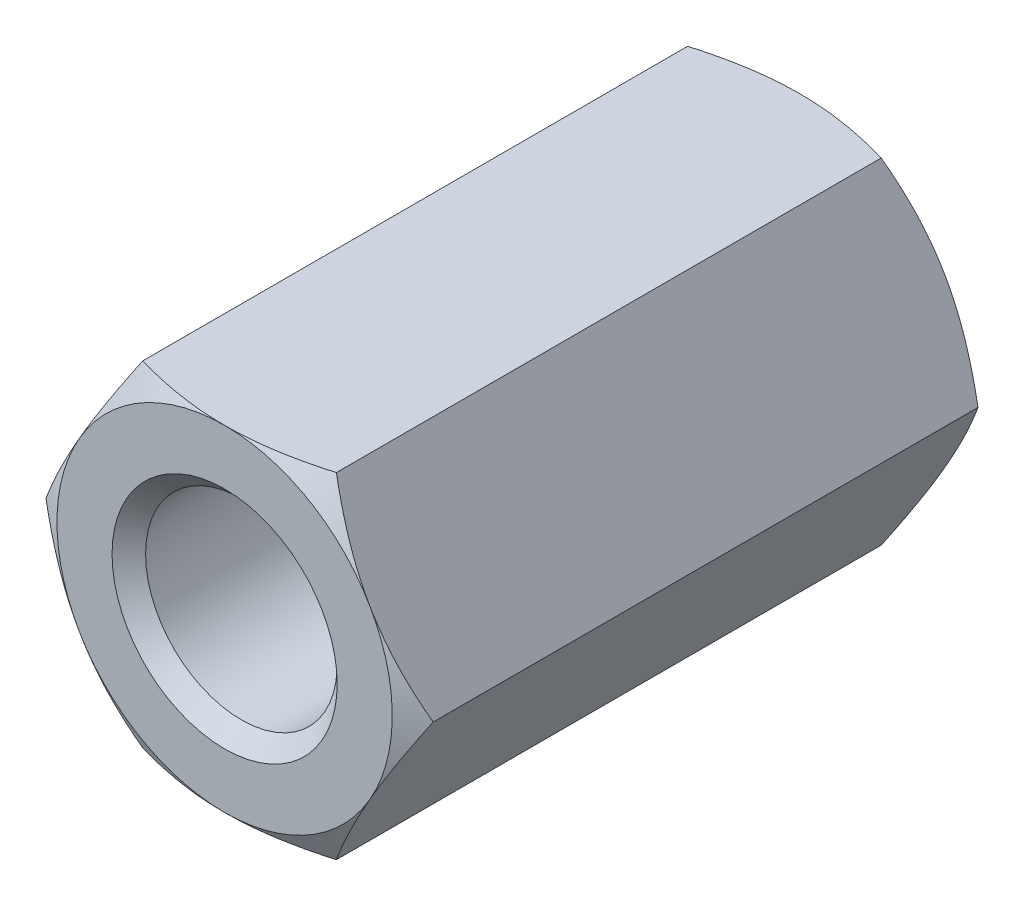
ISO-10303-21;
HEADER;
FILE_DESCRIPTION(('STEP AP214'),'2;1');
FILE_NAME('part.step','',(''),(''),'','','');
FILE_SCHEMA(('AUTOMOTIVE_DESIGN { 1 0 10303 214 1 1 1 1 }'));
ENDSEC;
DATA;
#1=APPLICATION_CONTEXT('core data for automotive mechanical design processes');
#2=APPLICATION_PROTOCOL_DEFINITION('international standard','automotive_design',2000,#1);
#3=PRODUCT_CONTEXT('',#1,'mechanical');
#4=PRODUCT('Part','Part','',(#3));
#5=PRODUCT_RELATED_PRODUCT_CATEGORY('part','',(#4));
#6=PRODUCT_DEFINITION_FORMATION('','',#4);
#7=PRODUCT_DEFINITION_CONTEXT('part definition',#1,'design');
#8=PRODUCT_DEFINITION('design','',#6,#7);
#9=PRODUCT_DEFINITION_SHAPE('','',#8);
#10=(LENGTH_UNIT() NAMED_UNIT(*) SI_UNIT(.MILLI.,.METRE.));
#11=(NAMED_UNIT(*) PLANE_ANGLE_UNIT() SI_UNIT($,.RADIAN.));
#12=(NAMED_UNIT(*) SI_UNIT($,.STERADIAN.) SOLID_ANGLE_UNIT());
#13=UNCERTAINTY_MEASURE_WITH_UNIT(LENGTH_MEASURE(1.E-05),#10,'distance_accuracy_value','');
#14=(GEOMETRIC_REPRESENTATION_CONTEXT(3) GLOBAL_UNCERTAINTY_ASSIGNED_CONTEXT((#13)) GLOBAL_UNIT_ASSIGNED_CONTEXT((#10,
#11,#12)) REPRESENTATION_CONTEXT('',''));
#15=CARTESIAN_POINT('',(0.,0.,0.));
#16=DIRECTION('',(0.,0.,1.));
#17=DIRECTION('',(1.,0.,0.));
#18=AXIS2_PLACEMENT_3D('',#15,#16,#17);
#19=CARTESIAN_POINT('',(4.04145188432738,0.,-6.));
#20=DIRECTION('',(0.866025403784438,0.5,0.));
#21=DIRECTION('',(-0.5,0.866025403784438,0.));
#22=AXIS2_PLACEMENT_3D('',#19,#20,#21);
#23=PLANE('',#22);
#24=CARTESIAN_POINT('',(4.04156735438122,-0.00019999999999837,5.68732593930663));
#25=CARTESIAN_POINT('',(3.9527667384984,0.153607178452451,5.73861421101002));
#26=CARTESIAN_POINT('',(3.86319960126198,0.308742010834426,5.7852590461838));
#27=CARTESIAN_POINT('',(3.68251437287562,0.621698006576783,5.86667812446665));
#28=CARTESIAN_POINT('',(3.59139307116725,0.779524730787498,5.90142356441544));
#29=CARTESIAN_POINT('',(3.41027974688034,1.09322221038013,5.95550997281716));
#30=CARTESIAN_POINT('',(3.32031559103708,1.24904469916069,5.97521091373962));
#31=CARTESIAN_POINT('',(3.13996396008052,1.56142288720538,5.99872986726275));
#32=CARTESIAN_POINT('',(3.04957714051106,1.71797745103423,6.00256735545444));
#33=CARTESIAN_POINT('',(2.88068384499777,2.01050921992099,5.99458469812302));
#34=CARTESIAN_POINT('',(2.80215208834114,2.14653021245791,5.98472456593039));
#35=CARTESIAN_POINT('',(2.64560020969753,2.417686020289,5.9534735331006));
#36=CARTESIAN_POINT('',(2.5675806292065,2.55281989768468,5.9320719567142));
#37=CARTESIAN_POINT('',(2.41070596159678,2.82453479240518,5.87856959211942));
#38=CARTESIAN_POINT('',(2.33187072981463,2.96108141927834,5.84624200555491));
#39=CARTESIAN_POINT('',(2.17537608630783,3.2321380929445,5.77287106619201));
#40=CARTESIAN_POINT('',(2.09771466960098,3.36665161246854,5.73184495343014));
#41=CARTESIAN_POINT('',(2.02061047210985,3.5002,5.68732593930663));
#42=B_SPLINE_CURVE_WITH_KNOTS('',3,(#24,#25,#26,#27,#28,#29,#30,#31,#32,#33,#34,#35,#36,#37,#38,
#39,#40,#41),.UNSPECIFIED.,.F.,.F.,(4,2,2,2,2,2,2,2,4),(0.,0.554793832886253,1.11092123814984,
1.65328467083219,2.19498204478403,2.6666513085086,3.13875761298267,3.6213361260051,
4.10296698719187),.UNSPECIFIED.);
#43=CARTESIAN_POINT('',(4.04145188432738,0.,5.68739260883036));
#44=VERTEX_POINT('',#43);
#45=CARTESIAN_POINT('',(3.03108891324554,1.75,6.));
#46=VERTEX_POINT('',#45);
#47=EDGE_CURVE('E127',#44,#46,#42,.T.);
#48=ORIENTED_EDGE('',*,*,#47,.F.);
#49=DIRECTION('',(0.,0.,1.));
#50=VECTOR('',#49,1.);
#51=CARTESIAN_POINT('',(4.04145188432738,0.,-6.));
#52=LINE('',#51,#50);
#53=CARTESIAN_POINT('',(4.04145188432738,0.,-5.68739260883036));
#54=VERTEX_POINT('',#53);
#55=EDGE_CURVE('E560',#54,#44,#52,.T.);
#56=ORIENTED_EDGE('',*,*,#55,.F.);
#57=CARTESIAN_POINT('',(4.04156735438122,-0.00019999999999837,-5.68732593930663));
#58=CARTESIAN_POINT('',(3.9527667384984,0.153607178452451,-5.73861421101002));
#59=CARTESIAN_POINT('',(3.86319960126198,0.308742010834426,-5.7852590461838));
#60=CARTESIAN_POINT('',(3.68251437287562,0.621698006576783,-5.86667812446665));
#61=CARTESIAN_POINT('',(3.59139307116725,0.779524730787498,-5.90142356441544));
#62=CARTESIAN_POINT('',(3.41027974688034,1.09322221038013,-5.95550997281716));
#63=CARTESIAN_POINT('',(3.32031559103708,1.24904469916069,-5.97521091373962));
#64=CARTESIAN_POINT('',(3.13996396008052,1.56142288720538,-5.99872986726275));
#65=CARTESIAN_POINT('',(3.04957714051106,1.71797745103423,-6.00256735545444));
#66=CARTESIAN_POINT('',(2.88068384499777,2.01050921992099,-5.99458469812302));
#67=CARTESIAN_POINT('',(2.80215208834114,2.14653021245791,-5.98472456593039));
#68=CARTESIAN_POINT('',(2.64560020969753,2.417686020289,-5.9534735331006));
#69=CARTESIAN_POINT('',(2.5675806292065,2.55281989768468,-5.9320719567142));
#70=CARTESIAN_POINT('',(2.41070596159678,2.82453479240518,-5.87856959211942));
#71=CARTESIAN_POINT('',(2.33187072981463,2.96108141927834,-5.84624200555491));
#72=CARTESIAN_POINT('',(2.17537608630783,3.2321380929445,-5.77287106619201));
#73=CARTESIAN_POINT('',(2.09771466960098,3.36665161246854,-5.73184495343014));
#74=CARTESIAN_POINT('',(2.02061047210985,3.5002,-5.68732593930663));
#75=B_SPLINE_CURVE_WITH_KNOTS('',3,(#57,#58,#59,#60,#61,#62,#63,#64,#65,#66,#67,#68,#69,#70,#71,
#72,#73,#74),.UNSPECIFIED.,.F.,.F.,(4,2,2,2,2,2,2,2,4),(0.,0.554793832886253,1.11092123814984,
1.65328467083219,2.19498204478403,2.6666513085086,3.13875761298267,3.6213361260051,
4.10296698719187),.UNSPECIFIED.);
#76=CARTESIAN_POINT('',(3.03108891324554,1.75,-6.));
#77=VERTEX_POINT('',#76);
#78=EDGE_CURVE('E573',#54,#77,#75,.T.);
#79=ORIENTED_EDGE('',*,*,#78,.T.);
#80=CARTESIAN_POINT('',(2.02072594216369,3.5,-5.68739260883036));
#81=VERTEX_POINT('',#80);
#82=EDGE_CURVE('E269',#77,#81,#75,.T.);
#83=ORIENTED_EDGE('',*,*,#82,.T.);
#84=DIRECTION('',(0.,0.,1.));
#85=VECTOR('',#84,1.);
#86=CARTESIAN_POINT('',(2.02072594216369,3.5,-6.));
#87=LINE('',#86,#85);
#88=CARTESIAN_POINT('',(2.02072594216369,3.5,5.68739260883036));
#89=VERTEX_POINT('',#88);
#90=EDGE_CURVE('E159',#81,#89,#87,.T.);
#91=ORIENTED_EDGE('',*,*,#90,.T.);
#92=EDGE_CURVE('E140',#46,#89,#42,.T.);
#93=ORIENTED_EDGE('',*,*,#92,.F.);
#94=EDGE_LOOP('',(#48,#56,#79,#83,#91,#93));
#95=FACE_BOUND('',#94,.T.);
#96=ADVANCED_FACE('F41',(#95),#23,.T.);
#97=CARTESIAN_POINT('',(2.02072594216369,-3.5,-6.));
#98=DIRECTION('',(0.866025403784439,-0.5,0.));
#99=DIRECTION('',(0.5,0.866025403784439,0.));
#100=AXIS2_PLACEMENT_3D('',#97,#98,#99);
#101=PLANE('',#100);
#102=CARTESIAN_POINT('',(2.02061047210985,-3.5002,5.68732593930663));
#103=CARTESIAN_POINT('',(2.10941108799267,-3.34639282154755,5.73861421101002));
#104=CARTESIAN_POINT('',(2.19897822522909,-3.19125798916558,5.7852590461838));
#105=CARTESIAN_POINT('',(2.37966345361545,-2.87830199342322,5.86667812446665));
#106=CARTESIAN_POINT('',(2.47078475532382,-2.7204752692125,5.90142356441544));
#107=CARTESIAN_POINT('',(2.65189807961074,-2.40677778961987,5.95550997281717));
#108=CARTESIAN_POINT('',(2.74186223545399,-2.25095530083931,5.97521091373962));
#109=CARTESIAN_POINT('',(2.92221386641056,-1.93857711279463,5.99872986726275));
#110=CARTESIAN_POINT('',(3.01260068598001,-1.78202254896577,6.00256735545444));
#111=CARTESIAN_POINT('',(3.1814939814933,-1.48949078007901,5.99458469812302));
#112=CARTESIAN_POINT('',(3.26002573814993,-1.35346978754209,5.98472456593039));
#113=CARTESIAN_POINT('',(3.41657761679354,-1.082313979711,5.9534735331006));
#114=CARTESIAN_POINT('',(3.49459719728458,-0.947180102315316,5.9320719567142));
#115=CARTESIAN_POINT('',(3.65147186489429,-0.675465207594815,5.87856959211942));
#116=CARTESIAN_POINT('',(3.73030709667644,-0.538918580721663,5.84624200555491));
#117=CARTESIAN_POINT('',(3.88680174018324,-0.267861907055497,5.77287106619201));
#118=CARTESIAN_POINT('',(3.96446315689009,-0.133348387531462,5.73184495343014));
#119=CARTESIAN_POINT('',(4.04156735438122,0.000200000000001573,5.68732593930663));
#120=B_SPLINE_CURVE_WITH_KNOTS('',3,(#102,#103,#104,#105,#106,#107,#108,#109,#110,#111,#112,
#113,#114,#115,#116,#117,#118,#119),.UNSPECIFIED.,.F.,.F.,(4,2,2,2,2,2,2,2,4),(0.,
0.554793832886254,1.11092123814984,1.65328467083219,2.19498204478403,2.6666513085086,
3.13875761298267,3.6213361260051,4.10296698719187),.UNSPECIFIED.);
#121=CARTESIAN_POINT('',(2.02072594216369,-3.5,5.68739260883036));
#122=VERTEX_POINT('',#121);
#123=CARTESIAN_POINT('',(3.03108891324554,-1.75,6.));
#124=VERTEX_POINT('',#123);
#125=EDGE_CURVE('E527',#122,#124,#120,.T.);
#126=ORIENTED_EDGE('',*,*,#125,.F.);
#127=DIRECTION('',(0.,0.,1.));
#128=VECTOR('',#127,1.);
#129=CARTESIAN_POINT('',(2.02072594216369,-3.5,-6.));
#130=LINE('',#129,#128);
#131=CARTESIAN_POINT('',(2.02072594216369,-3.5,-5.68739260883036));
#132=VERTEX_POINT('',#131);
#133=EDGE_CURVE('E283',#132,#122,#130,.T.);
#134=ORIENTED_EDGE('',*,*,#133,.F.);
#135=CARTESIAN_POINT('',(2.02061047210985,-3.5002,-5.68732593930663));
#136=CARTESIAN_POINT('',(2.10941108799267,-3.34639282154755,-5.73861421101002));
#137=CARTESIAN_POINT('',(2.19897822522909,-3.19125798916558,-5.7852590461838));
#138=CARTESIAN_POINT('',(2.37966345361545,-2.87830199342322,-5.86667812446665));
#139=CARTESIAN_POINT('',(2.47078475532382,-2.7204752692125,-5.90142356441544));
#140=CARTESIAN_POINT('',(2.65189807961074,-2.40677778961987,-5.95550997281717));
#141=CARTESIAN_POINT('',(2.74186223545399,-2.25095530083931,-5.97521091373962));
#142=CARTESIAN_POINT('',(2.92221386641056,-1.93857711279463,-5.99872986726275));
#143=CARTESIAN_POINT('',(3.01260068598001,-1.78202254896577,-6.00256735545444));
#144=CARTESIAN_POINT('',(3.1814939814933,-1.48949078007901,-5.99458469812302));
#145=CARTESIAN_POINT('',(3.26002573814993,-1.35346978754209,-5.98472456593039));
#146=CARTESIAN_POINT('',(3.41657761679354,-1.082313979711,-5.9534735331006));
#147=CARTESIAN_POINT('',(3.49459719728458,-0.947180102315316,-5.9320719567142));
#148=CARTESIAN_POINT('',(3.65147186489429,-0.675465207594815,-5.87856959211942));
#149=CARTESIAN_POINT('',(3.73030709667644,-0.538918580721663,-5.84624200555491));
#150=CARTESIAN_POINT('',(3.88680174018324,-0.267861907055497,-5.77287106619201));
#151=CARTESIAN_POINT('',(3.96446315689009,-0.133348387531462,-5.73184495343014));
#152=CARTESIAN_POINT('',(4.04156735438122,0.000200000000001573,-5.68732593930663));
#153=B_SPLINE_CURVE_WITH_KNOTS('',3,(#135,#136,#137,#138,#139,#140,#141,#142,#143,#144,#145,
#146,#147,#148,#149,#150,#151,#152),.UNSPECIFIED.,.F.,.F.,(4,2,2,2,2,2,2,2,4),(0.,
0.554793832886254,1.11092123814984,1.65328467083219,2.19498204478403,2.6666513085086,
3.13875761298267,3.6213361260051,4.10296698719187),.UNSPECIFIED.);
#154=CARTESIAN_POINT('',(3.03108891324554,-1.75,-6.));
#155=VERTEX_POINT('',#154);
#156=EDGE_CURVE('E529',#132,#155,#153,.T.);
#157=ORIENTED_EDGE('',*,*,#156,.T.);
#158=EDGE_CURVE('E284',#155,#54,#153,.T.);
#159=ORIENTED_EDGE('',*,*,#158,.T.);
#160=ORIENTED_EDGE('',*,*,#55,.T.);
#161=EDGE_CURVE('E132',#124,#44,#120,.T.);
#162=ORIENTED_EDGE('',*,*,#161,.F.);
#163=EDGE_LOOP('',(#126,#134,#157,#159,#160,#162));
#164=FACE_BOUND('',#163,.T.);
#165=ADVANCED_FACE('F254',(#164),#101,.T.);
#166=CARTESIAN_POINT('',(-2.02072594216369,-3.5,-6.));
#167=DIRECTION('',(0.,-1.,0.));
#168=DIRECTION('',(1.,0.,0.));
#169=AXIS2_PLACEMENT_3D('',#166,#167,#168);
#170=PLANE('',#169);
#171=CARTESIAN_POINT('',(-12.0038871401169,-3.5,0.801693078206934));
#172=CARTESIAN_POINT('',(-11.7396328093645,-3.5,0.948152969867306));
#173=CARTESIAN_POINT('',(-11.4752242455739,-3.5,1.09433556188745));
#174=CARTESIAN_POINT('',(-10.9460153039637,-3.5,1.38599563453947));
#175=CARTESIAN_POINT('',(-10.6812149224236,-3.5,1.53147310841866));
#176=CARTESIAN_POINT('',(-10.1510358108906,-3.5,1.82162886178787));
#177=CARTESIAN_POINT('',(-9.88565688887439,-3.5,1.96630679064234));
#178=CARTESIAN_POINT('',(-9.35431765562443,-3.5,2.25458926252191));
#179=CARTESIAN_POINT('',(-9.08835734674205,-3.5,2.3981938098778));
#180=CARTESIAN_POINT('',(-8.55285730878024,-3.5,2.6855750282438));
#181=CARTESIAN_POINT('',(-8.28330973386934,-3.5,2.82933709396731));
#182=CARTESIAN_POINT('',(-7.74326558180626,-3.5,3.1150670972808));
#183=CARTESIAN_POINT('',(-7.47276900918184,-3.5,3.25703504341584));
#184=CARTESIAN_POINT('',(-6.93059286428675,-3.5,3.53857393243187));
#185=CARTESIAN_POINT('',(-6.65891352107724,-3.5,3.67814531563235));
#186=CARTESIAN_POINT('',(-6.11393032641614,-3.5,3.95407473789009));
#187=CARTESIAN_POINT('',(-5.84062651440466,-3.5,4.09043285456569));
#188=CARTESIAN_POINT('',(-5.28935696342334,-3.5,4.35987221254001));
#189=CARTESIAN_POINT('',(-5.01137140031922,-3.5,4.49291301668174));
#190=CARTESIAN_POINT('',(-4.45225285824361,-3.5,4.75245705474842));
#191=CARTESIAN_POINT('',(-4.17111919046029,-3.5,4.87895882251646));
#192=CARTESIAN_POINT('',(-3.74620020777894,-3.5,5.06127020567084));
#193=CARTESIAN_POINT('',(-3.6040151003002,-3.5,5.1208039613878));
#194=CARTESIAN_POINT('',(-3.31838638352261,-3.5,5.23676303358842));
#195=CARTESIAN_POINT('',(-3.17494284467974,-3.5,5.29318852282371));
#196=CARTESIAN_POINT('',(-2.88661057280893,-3.5,5.40216104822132));
#197=CARTESIAN_POINT('',(-2.74172210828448,-3.5,5.45470879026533));
#198=CARTESIAN_POINT('',(-2.45028244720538,-3.5,5.55494714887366));
#199=CARTESIAN_POINT('',(-2.30373142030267,-3.5,5.60263825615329));
#200=CARTESIAN_POINT('',(-1.96170072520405,-3.5,5.70622148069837));
#201=CARTESIAN_POINT('',(-1.76553025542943,-3.5,5.75987450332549));
#202=CARTESIAN_POINT('',(-1.36983675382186,-3.5,5.85323961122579));
#203=CARTESIAN_POINT('',(-1.17031460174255,-3.5,5.89295529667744));
#204=CARTESIAN_POINT('',(-0.869861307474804,-3.5,5.9392666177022));
#205=CARTESIAN_POINT('',(-0.769932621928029,-3.5,5.95246563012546));
#206=CARTESIAN_POINT('',(-0.569574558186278,-3.5,5.97420479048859));
#207=CARTESIAN_POINT('',(-0.469145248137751,-3.5,5.98274555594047));
#208=CARTESIAN_POINT('',(-0.267996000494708,-3.5,5.99490772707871));
#209=CARTESIAN_POINT('',(-0.167276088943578,-3.5,5.99852956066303));
#210=CARTESIAN_POINT('',(0.0342192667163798,-3.5,6.00074039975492));
#211=CARTESIAN_POINT('',(0.134994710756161,-3.5,5.99932941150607));
#212=CARTESIAN_POINT('',(0.335942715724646,-3.5,5.99153478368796));
#213=CARTESIAN_POINT('',(0.436116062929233,-3.5,5.98517136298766));
#214=CARTESIAN_POINT('',(0.636051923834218,-3.5,5.96769705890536));
#215=CARTESIAN_POINT('',(0.735814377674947,-3.5,5.95658550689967));
#216=CARTESIAN_POINT('',(1.03422657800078,-3.5,5.91658323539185));
#217=CARTESIAN_POINT('',(1.23201066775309,-3.5,5.8810244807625));
#218=CARTESIAN_POINT('',(1.52815612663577,-3.5,5.81643944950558));
#219=CARTESIAN_POINT('',(1.62775260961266,-3.5,5.79274813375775));
#220=CARTESIAN_POINT('',(1.82611224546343,-3.5,5.74207225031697));
#221=CARTESIAN_POINT('',(1.92487538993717,-3.5,5.7150876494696));
#222=CARTESIAN_POINT('',(2.12156246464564,-3.5,5.65825757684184));
#223=CARTESIAN_POINT('',(2.2194864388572,-3.5,5.628412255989));
#224=CARTESIAN_POINT('',(2.41453675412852,-3.5,5.56624787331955));
#225=CARTESIAN_POINT('',(2.51166313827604,-3.5,5.53392894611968));
#226=CARTESIAN_POINT('',(2.82909358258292,-3.5,5.42442374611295));
#227=CARTESIAN_POINT('',(3.04786183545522,-3.5,5.34278014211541));
#228=CARTESIAN_POINT('',(3.48233231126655,-3.5,5.17166424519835));
#229=CARTESIAN_POINT('',(3.69803364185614,-3.5,5.08218972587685));
#230=CARTESIAN_POINT('',(4.12719903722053,-3.5,4.89751690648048));
#231=CARTESIAN_POINT('',(4.3406608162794,-3.5,4.8023133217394));
#232=CARTESIAN_POINT('',(4.76565456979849,-3.5,4.60777420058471));
#233=CARTESIAN_POINT('',(4.97718674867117,-3.5,4.50843910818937));
#234=CARTESIAN_POINT('',(5.39950421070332,-3.5,4.30630962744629));
#235=CARTESIAN_POINT('',(5.61028423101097,-3.5,4.20350427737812));
#236=CARTESIAN_POINT('',(6.03066536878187,-3.5,3.99550522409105));
#237=CARTESIAN_POINT('',(6.2402664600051,-3.5,3.89031146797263));
#238=CARTESIAN_POINT('',(6.65841365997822,-3.5,3.67812543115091));
#239=CARTESIAN_POINT('',(6.86696027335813,-3.5,3.57113414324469));
#240=CARTESIAN_POINT('',(7.28329408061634,-3.5,3.35568302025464));
#241=CARTESIAN_POINT('',(7.49108126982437,-3.5,3.24722317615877));
#242=CARTESIAN_POINT('',(8.0611033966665,-3.5,2.94763478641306));
#243=CARTESIAN_POINT('',(8.42270599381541,-3.5,2.75530364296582));
#244=CARTESIAN_POINT('',(9.14461856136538,-3.5,2.36810671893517));
#245=CARTESIAN_POINT('',(9.50492832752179,-3.5,2.17324055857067));
#246=CARTESIAN_POINT('',(10.2221285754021,-3.5,1.7830030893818));
#247=CARTESIAN_POINT('',(10.5790257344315,-3.5,1.58764403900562));
#248=CARTESIAN_POINT('',(11.2920001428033,-3.5,1.19558055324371));
#249=CARTESIAN_POINT('',(11.6480775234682,-3.5,0.998876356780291));
#250=CARTESIAN_POINT('',(12.0038871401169,-3.5,0.801693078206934));
#251=B_SPLINE_CURVE_WITH_KNOTS('',3,(#171,#172,#173,#174,#175,#176,#177,#178,#179,#180,#181,
#182,#183,#184,#185,#186,#187,#188,#189,#190,#191,#192,#193,#194,#195,#196,#197,#198,#199,#200,
#201,#202,#203,#204,#205,#206,#207,#208,#209,#210,#211,#212,#213,#214,#215,#216,#217,#218,#219,
#220,#221,#222,#223,#224,#225,#226,#227,#228,#229,#230,#231,#232,#233,#234,#235,#236,#237,#238,
#239,#240,#241,#242,#243,#244,#245,#246,#247,#248,#249,#250),.UNSPECIFIED.,.F.,.F.,(4,2,2,2,2,2,
2,2,2,2,2,2,2,2,2,2,2,2,2,2,2,2,2,2,2,2,2,2,2,2,2,2,2,2,2,2,2,2,2,4),(0.,0.906382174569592,
1.81277301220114,2.7195340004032,3.62629132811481,4.54275274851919,5.4592098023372,
6.37549663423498,7.29176130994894,8.21625641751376,9.14095792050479,9.60336677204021,
10.0657498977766,10.5280486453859,10.990300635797,11.6000551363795,12.209652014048,
12.5119496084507,12.8142071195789,13.1164383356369,13.4186691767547,13.7196725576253,
14.0207183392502,14.6227814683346,14.9298715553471,15.2369647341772,15.5440417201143,
15.8511020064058,16.5513740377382,17.2518458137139,17.9529739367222,18.6540269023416,
19.3575515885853,20.0610918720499,20.7642555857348,21.4674236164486,22.6961180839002,
23.9249987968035,25.1455962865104,26.3659823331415),.UNSPECIFIED.);
#252=CARTESIAN_POINT('',(-2.02072594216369,-3.5,5.68739260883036));
#253=VERTEX_POINT('',#252);
#254=CARTESIAN_POINT('',(0.,-3.5,6.));
#255=VERTEX_POINT('',#254);
#256=EDGE_CURVE('E607',#253,#255,#251,.T.);
#257=ORIENTED_EDGE('',*,*,#256,.F.);
#258=DIRECTION('',(0.,0.,1.));
#259=VECTOR('',#258,1.);
#260=CARTESIAN_POINT('',(-2.02072594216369,-3.5,-6.));
#261=LINE('',#260,#259);
#262=CARTESIAN_POINT('',(-2.02072594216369,-3.5,-5.68739260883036));
#263=VERTEX_POINT('',#262);
#264=EDGE_CURVE('E548',#263,#253,#261,.T.);
#265=ORIENTED_EDGE('',*,*,#264,.F.);
#266=CARTESIAN_POINT('',(-8.46638501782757,-3.5,-2.73143880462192));
#267=CARTESIAN_POINT('',(-8.27532704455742,-3.5,-2.8333687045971));
#268=CARTESIAN_POINT('',(-8.08406700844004,-3.5,-2.93492223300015));
#269=CARTESIAN_POINT('',(-7.70104457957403,-3.5,-3.13708052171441));
#270=CARTESIAN_POINT('',(-7.50928218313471,-3.5,-3.23768527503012));
#271=CARTESIAN_POINT('',(-7.12495813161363,-3.5,-3.43785341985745));
#272=CARTESIAN_POINT('',(-6.93239584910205,-3.5,-3.53741560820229));
#273=CARTESIAN_POINT('',(-6.5465401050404,-3.5,-3.73511930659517));
#274=CARTESIAN_POINT('',(-6.35324663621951,-3.5,-3.83326080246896));
#275=CARTESIAN_POINT('',(-5.9554377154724,-3.5,-4.03295034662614));
#276=CARTESIAN_POINT('',(-5.75087332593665,-3.5,-4.13440110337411));
#277=CARTESIAN_POINT('',(-5.3405082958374,-3.5,-4.33476036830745));
#278=CARTESIAN_POINT('',(-5.1347076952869,-3.5,-4.43366895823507));
#279=CARTESIAN_POINT('',(-4.72163304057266,-3.5,-4.62811118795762));
#280=CARTESIAN_POINT('',(-4.51435974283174,-3.5,-4.72364642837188));
#281=CARTESIAN_POINT('',(-4.09777990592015,-3.5,-4.91028515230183));
#282=CARTESIAN_POINT('',(-3.88847306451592,-3.5,-5.00138796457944));
#283=CARTESIAN_POINT('',(-3.4519285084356,-3.5,-5.18397379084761));
#284=CARTESIAN_POINT('',(-3.22449742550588,-3.5,-5.2749988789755));
#285=CARTESIAN_POINT('',(-2.76594610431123,-3.5,-5.44713557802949));
#286=CARTESIAN_POINT('',(-2.53482715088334,-3.5,-5.52825055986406));
#287=CARTESIAN_POINT('',(-2.07240270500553,-3.5,-5.67493190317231));
#288=CARTESIAN_POINT('',(-1.8411828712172,-3.5,-5.74076256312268));
#289=CARTESIAN_POINT('',(-1.37409223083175,-3.5,-5.85329331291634));
#290=CARTESIAN_POINT('',(-1.13822405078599,-3.5,-5.90000389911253));
#291=CARTESIAN_POINT('',(-0.707379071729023,-3.5,-5.9619614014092));
#292=CARTESIAN_POINT('',(-0.513036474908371,-3.5,-5.98146824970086));
#293=CARTESIAN_POINT('',(-0.220865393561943,-3.5,-5.99676068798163));
#294=CARTESIAN_POINT('',(-0.12337169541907,-3.5,-5.99953046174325));
#295=CARTESIAN_POINT('',(0.0716423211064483,-3.5,-6.00035918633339));
#296=CARTESIAN_POINT('',(0.16916263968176,-3.5,-5.99841810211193));
#297=CARTESIAN_POINT('',(0.365693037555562,-3.5,-5.98980184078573));
#298=CARTESIAN_POINT('',(0.464699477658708,-3.5,-5.98304479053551));
#299=CARTESIAN_POINT('',(0.662289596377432,-3.5,-5.96491207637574));
#300=CARTESIAN_POINT('',(0.760873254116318,-3.5,-5.95353618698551));
#301=CARTESIAN_POINT('',(0.957461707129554,-3.5,-5.92647864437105));
#302=CARTESIAN_POINT('',(1.05546639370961,-3.5,-5.91079620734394));
#303=CARTESIAN_POINT('',(1.25075429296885,-3.5,-5.8755154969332));
#304=CARTESIAN_POINT('',(1.34803755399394,-3.5,-5.85591748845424));
#305=CARTESIAN_POINT('',(1.60644034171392,-3.5,-5.798987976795));
#306=CARTESIAN_POINT('',(1.76687651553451,-3.5,-5.75854486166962));
#307=CARTESIAN_POINT('',(2.08557665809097,-3.5,-5.66983156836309));
#308=CARTESIAN_POINT('',(2.24383999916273,-3.5,-5.62155917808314));
#309=CARTESIAN_POINT('',(2.55856095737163,-3.5,-5.51876851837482));
#310=CARTESIAN_POINT('',(2.71501563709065,-3.5,-5.46424133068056));
#311=CARTESIAN_POINT('',(3.02611627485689,-3.5,-5.35033782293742));
#312=CARTESIAN_POINT('',(3.18076242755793,-3.5,-5.29096203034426));
#313=CARTESIAN_POINT('',(3.48959375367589,-3.5,-5.16796799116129));
#314=CARTESIAN_POINT('',(3.64376829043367,-3.5,-5.10432317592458));
#315=CARTESIAN_POINT('',(3.95081833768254,-3.5,-4.97397109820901));
#316=CARTESIAN_POINT('',(4.10369380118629,-3.5,-4.9072637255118));
#317=CARTESIAN_POINT('',(4.40823556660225,-3.5,-4.77145966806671));
#318=CARTESIAN_POINT('',(4.55990270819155,-3.5,-4.70236486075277));
#319=CARTESIAN_POINT('',(4.86232527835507,-3.5,-4.5622052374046));
#320=CARTESIAN_POINT('',(5.01308068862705,-3.5,-4.49114038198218));
#321=CARTESIAN_POINT('',(5.44443417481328,-3.5,-4.28500275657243));
#322=CARTESIAN_POINT('',(5.72408287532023,-3.5,-4.14794462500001));
#323=CARTESIAN_POINT('',(6.28148920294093,-3.5,-3.86992200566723));
#324=CARTESIAN_POINT('',(6.55924644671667,-3.5,-3.72895675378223));
#325=CARTESIAN_POINT('',(7.10919659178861,-3.5,-3.44633598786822));
#326=CARTESIAN_POINT('',(7.38141082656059,-3.5,-3.30472189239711));
#327=CARTESIAN_POINT('',(7.92467418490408,-3.5,-3.01945605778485));
#328=CARTESIAN_POINT('',(8.19572361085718,-3.5,-2.87580489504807));
#329=CARTESIAN_POINT('',(8.46638501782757,-3.5,-2.73143880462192));
#330=B_SPLINE_CURVE_WITH_KNOTS('',3,(#266,#267,#268,#269,#270,#271,#272,#273,#274,#275,#276,
#277,#278,#279,#280,#281,#282,#283,#284,#285,#286,#287,#288,#289,#290,#291,#292,#293,#294,#295,
#296,#297,#298,#299,#300,#301,#302,#303,#304,#305,#306,#307,#308,#309,#310,#311,#312,#313,#314,
#315,#316,#317,#318,#319,#320,#321,#322,#323,#324,#325,#326,#327,#328,#329),.UNSPECIFIED.,.F.,
.F.,(4,2,2,2,2,2,2,2,2,2,2,2,2,2,2,2,2,2,2,2,2,2,2,2,2,2,2,2,2,2,2,4),(0.,0.649643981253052,
1.29929274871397,1.94962303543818,2.59995980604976,3.2849642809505,3.96994670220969,
4.65459961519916,5.3393558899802,6.07410963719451,6.80861275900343,7.52926879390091,
8.24952867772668,8.83460221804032,9.12710195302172,9.41960386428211,9.71720080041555,
10.0148122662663,10.3124779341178,10.6101234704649,11.1062167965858,11.6024505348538,
12.0994008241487,12.5962971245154,13.0966398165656,13.5970005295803,14.0969763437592,
14.5969621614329,15.531201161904,16.4656241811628,17.3861552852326,18.3064309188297),.UNSPECIFIED.);
#331=CARTESIAN_POINT('',(0.,-3.5,-6.));
#332=VERTEX_POINT('',#331);
#333=EDGE_CURVE('E541',#263,#332,#330,.T.);
#334=ORIENTED_EDGE('',*,*,#333,.T.);
#335=EDGE_CURVE('E259',#332,#132,#330,.T.);
#336=ORIENTED_EDGE('',*,*,#335,.T.);
#337=ORIENTED_EDGE('',*,*,#133,.T.);
#338=EDGE_CURVE('E138',#255,#122,#251,.T.);
#339=ORIENTED_EDGE('',*,*,#338,.F.);
#340=EDGE_LOOP('',(#257,#265,#334,#336,#337,#339));
#341=FACE_BOUND('',#340,.T.);
#342=ADVANCED_FACE('F292',(#341),#170,.T.);
#343=CARTESIAN_POINT('',(-4.04145188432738,0.,-6.));
#344=DIRECTION('',(-0.866025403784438,-0.5,0.));
#345=DIRECTION('',(0.5,-0.866025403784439,0.));
#346=AXIS2_PLACEMENT_3D('',#343,#344,#345);
#347=PLANE('',#346);
#348=CARTESIAN_POINT('',(-4.04156735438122,0.000199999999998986,5.68732593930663));
#349=CARTESIAN_POINT('',(-3.9527667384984,-0.15360717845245,5.73861421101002));
#350=CARTESIAN_POINT('',(-3.86319960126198,-0.308742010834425,5.78525904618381));
#351=CARTESIAN_POINT('',(-3.68251437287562,-0.621698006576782,5.86667812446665));
#352=CARTESIAN_POINT('',(-3.59139307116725,-0.779524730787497,5.90142356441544));
#353=CARTESIAN_POINT('',(-3.41027974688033,-1.09322221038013,5.95550997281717));
#354=CARTESIAN_POINT('',(-3.32031559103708,-1.24904469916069,5.97521091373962));
#355=CARTESIAN_POINT('',(-3.13996396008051,-1.56142288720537,5.99872986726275));
#356=CARTESIAN_POINT('',(-3.04957714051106,-1.71797745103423,6.00256735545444));
#357=CARTESIAN_POINT('',(-2.88068384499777,-2.01050921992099,5.99458469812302));
#358=CARTESIAN_POINT('',(-2.80215208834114,-2.14653021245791,5.98472456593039));
#359=CARTESIAN_POINT('',(-2.64560020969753,-2.41768602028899,5.9534735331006));
#360=CARTESIAN_POINT('',(-2.56758062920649,-2.55281989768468,5.9320719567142));
#361=CARTESIAN_POINT('',(-2.41070596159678,-2.82453479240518,5.87856959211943));
#362=CARTESIAN_POINT('',(-2.33187072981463,-2.96108141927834,5.84624200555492));
#363=CARTESIAN_POINT('',(-2.17537608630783,-3.2321380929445,5.77287106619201));
#364=CARTESIAN_POINT('',(-2.09771466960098,-3.36665161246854,5.73184495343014));
#365=CARTESIAN_POINT('',(-2.02061047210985,-3.5002,5.68732593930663));
#366=B_SPLINE_CURVE_WITH_KNOTS('',3,(#348,#349,#350,#351,#352,#353,#354,#355,#356,#357,#358,
#359,#360,#361,#362,#363,#364,#365),.UNSPECIFIED.,.F.,.F.,(4,2,2,2,2,2,2,2,4),(0.,
0.554793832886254,1.11092123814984,1.65328467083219,2.19498204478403,2.6666513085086,
3.13875761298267,3.6213361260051,4.10296698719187),.UNSPECIFIED.);
#367=CARTESIAN_POINT('',(-4.04145188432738,0.,5.68739260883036));
#368=VERTEX_POINT('',#367);
#369=CARTESIAN_POINT('',(-3.03108891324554,-1.75,6.));
#370=VERTEX_POINT('',#369);
#371=EDGE_CURVE('E176',#368,#370,#366,.T.);
#372=ORIENTED_EDGE('',*,*,#371,.F.);
#373=DIRECTION('',(0.,0.,1.));
#374=VECTOR('',#373,1.);
#375=CARTESIAN_POINT('',(-4.04145188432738,0.,-6.));
#376=LINE('',#375,#374);
#377=CARTESIAN_POINT('',(-4.04145188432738,0.,-5.68739260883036));
#378=VERTEX_POINT('',#377);
#379=EDGE_CURVE('E538',#378,#368,#376,.T.);
#380=ORIENTED_EDGE('',*,*,#379,.F.);
#381=CARTESIAN_POINT('',(-4.04156735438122,0.000199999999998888,-5.68732593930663));
#382=CARTESIAN_POINT('',(-3.9527667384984,-0.153607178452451,-5.73861421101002));
#383=CARTESIAN_POINT('',(-3.86319960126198,-0.308742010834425,-5.78525904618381));
#384=CARTESIAN_POINT('',(-3.68251437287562,-0.621698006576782,-5.86667812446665));
#385=CARTESIAN_POINT('',(-3.59139307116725,-0.779524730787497,-5.90142356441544));
#386=CARTESIAN_POINT('',(-3.41027974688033,-1.09322221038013,-5.95550997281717));
#387=CARTESIAN_POINT('',(-3.32031559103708,-1.24904469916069,-5.97521091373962));
#388=CARTESIAN_POINT('',(-3.13996396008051,-1.56142288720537,-5.99872986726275));
#389=CARTESIAN_POINT('',(-3.04957714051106,-1.71797745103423,-6.00256735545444));
#390=CARTESIAN_POINT('',(-2.88068384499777,-2.01050921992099,-5.99458469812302));
#391=CARTESIAN_POINT('',(-2.80215208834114,-2.14653021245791,-5.98472456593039));
#392=CARTESIAN_POINT('',(-2.64560020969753,-2.41768602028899,-5.9534735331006));
#393=CARTESIAN_POINT('',(-2.56758062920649,-2.55281989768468,-5.9320719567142));
#394=CARTESIAN_POINT('',(-2.41070596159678,-2.82453479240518,-5.87856959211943));
#395=CARTESIAN_POINT('',(-2.33187072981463,-2.96108141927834,-5.84624200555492));
#396=CARTESIAN_POINT('',(-2.17537608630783,-3.2321380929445,-5.77287106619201));
#397=CARTESIAN_POINT('',(-2.09771466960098,-3.36665161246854,-5.73184495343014));
#398=CARTESIAN_POINT('',(-2.02061047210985,-3.5002,-5.68732593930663));
#399=B_SPLINE_CURVE_WITH_KNOTS('',3,(#381,#382,#383,#384,#385,#386,#387,#388,#389,#390,#391,
#392,#393,#394,#395,#396,#397,#398),.UNSPECIFIED.,.F.,.F.,(4,2,2,2,2,2,2,2,4),(0.,
0.554793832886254,1.11092123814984,1.65328467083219,2.19498204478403,2.6666513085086,
3.13875761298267,3.6213361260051,4.10296698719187),.UNSPECIFIED.);
#400=CARTESIAN_POINT('',(-3.03108891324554,-1.75,-6.));
#401=VERTEX_POINT('',#400);
#402=EDGE_CURVE('E275',#378,#401,#399,.T.);
#403=ORIENTED_EDGE('',*,*,#402,.T.);
#404=EDGE_CURVE('E282',#401,#263,#399,.T.);
#405=ORIENTED_EDGE('',*,*,#404,.T.);
#406=ORIENTED_EDGE('',*,*,#264,.T.);
#407=EDGE_CURVE('E608',#370,#253,#366,.T.);
#408=ORIENTED_EDGE('',*,*,#407,.F.);
#409=EDGE_LOOP('',(#372,#380,#403,#405,#406,#408));
#410=FACE_BOUND('',#409,.T.);
#411=ADVANCED_FACE('F289',(#410),#347,.T.);
#412=CARTESIAN_POINT('',(-2.02072594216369,3.5,-6.));
#413=DIRECTION('',(-0.866025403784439,0.5,0.));
#414=DIRECTION('',(-0.5,-0.866025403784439,0.));
#415=AXIS2_PLACEMENT_3D('',#412,#413,#414);
#416=PLANE('',#415);
#417=CARTESIAN_POINT('',(-2.02061047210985,3.5002,5.68732593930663));
#418=CARTESIAN_POINT('',(-2.10941108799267,3.34639282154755,5.73861421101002));
#419=CARTESIAN_POINT('',(-2.19897822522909,3.19125798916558,5.78525904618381));
#420=CARTESIAN_POINT('',(-2.37966345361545,2.87830199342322,5.86667812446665));
#421=CARTESIAN_POINT('',(-2.47078475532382,2.7204752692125,5.90142356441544));
#422=CARTESIAN_POINT('',(-2.65189807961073,2.40677778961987,5.95550997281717));
#423=CARTESIAN_POINT('',(-2.74186223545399,2.25095530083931,5.97521091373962));
#424=CARTESIAN_POINT('',(-2.92221386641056,1.93857711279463,5.99872986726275));
#425=CARTESIAN_POINT('',(-3.01260068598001,1.78202254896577,6.00256735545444));
#426=CARTESIAN_POINT('',(-3.1814939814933,1.48949078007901,5.99458469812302));
#427=CARTESIAN_POINT('',(-3.26002573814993,1.35346978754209,5.98472456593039));
#428=CARTESIAN_POINT('',(-3.41657761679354,1.082313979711,5.9534735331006));
#429=CARTESIAN_POINT('',(-3.49459719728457,0.947180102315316,5.9320719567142));
#430=CARTESIAN_POINT('',(-3.65147186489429,0.675465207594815,5.87856959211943));
#431=CARTESIAN_POINT('',(-3.73030709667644,0.538918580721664,5.84624200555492));
#432=CARTESIAN_POINT('',(-3.88680174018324,0.267861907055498,5.77287106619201));
#433=CARTESIAN_POINT('',(-3.96446315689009,0.133348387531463,5.73184495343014));
#434=CARTESIAN_POINT('',(-4.04156735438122,-0.000200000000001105,5.68732593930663));
#435=B_SPLINE_CURVE_WITH_KNOTS('',3,(#417,#418,#419,#420,#421,#422,#423,#424,#425,#426,#427,
#428,#429,#430,#431,#432,#433,#434),.UNSPECIFIED.,.F.,.F.,(4,2,2,2,2,2,2,2,4),(0.,
0.554793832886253,1.11092123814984,1.65328467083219,2.19498204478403,2.6666513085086,
3.13875761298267,3.6213361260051,4.10296698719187),.UNSPECIFIED.);
#436=CARTESIAN_POINT('',(-2.02072594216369,3.5,5.68739260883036));
#437=VERTEX_POINT('',#436);
#438=CARTESIAN_POINT('',(-3.03108891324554,1.75,6.));
#439=VERTEX_POINT('',#438);
#440=EDGE_CURVE('E183',#437,#439,#435,.T.);
#441=ORIENTED_EDGE('',*,*,#440,.F.);
#442=DIRECTION('',(0.,0.,1.));
#443=VECTOR('',#442,1.);
#444=CARTESIAN_POINT('',(-2.02072594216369,3.5,-6.));
#445=LINE('',#444,#443);
#446=CARTESIAN_POINT('',(-2.02072594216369,3.5,-5.68739260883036));
#447=VERTEX_POINT('',#446);
#448=EDGE_CURVE('E233',#447,#437,#445,.T.);
#449=ORIENTED_EDGE('',*,*,#448,.F.);
#450=CARTESIAN_POINT('',(-2.02061047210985,3.5002,-5.68732593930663));
#451=CARTESIAN_POINT('',(-2.10941108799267,3.34639282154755,-5.73861421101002));
#452=CARTESIAN_POINT('',(-2.19897822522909,3.19125798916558,-5.78525904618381));
#453=CARTESIAN_POINT('',(-2.37966345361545,2.87830199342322,-5.86667812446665));
#454=CARTESIAN_POINT('',(-2.47078475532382,2.7204752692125,-5.90142356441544));
#455=CARTESIAN_POINT('',(-2.65189807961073,2.40677778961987,-5.95550997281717));
#456=CARTESIAN_POINT('',(-2.74186223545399,2.25095530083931,-5.97521091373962));
#457=CARTESIAN_POINT('',(-2.92221386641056,1.93857711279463,-5.99872986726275));
#458=CARTESIAN_POINT('',(-3.01260068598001,1.78202254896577,-6.00256735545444));
#459=CARTESIAN_POINT('',(-3.1814939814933,1.48949078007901,-5.99458469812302));
#460=CARTESIAN_POINT('',(-3.26002573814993,1.35346978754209,-5.98472456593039));
#461=CARTESIAN_POINT('',(-3.41657761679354,1.082313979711,-5.9534735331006));
#462=CARTESIAN_POINT('',(-3.49459719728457,0.947180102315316,-5.9320719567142));
#463=CARTESIAN_POINT('',(-3.65147186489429,0.675465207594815,-5.87856959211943));
#464=CARTESIAN_POINT('',(-3.73030709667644,0.538918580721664,-5.84624200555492));
#465=CARTESIAN_POINT('',(-3.88680174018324,0.267861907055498,-5.77287106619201));
#466=CARTESIAN_POINT('',(-3.96446315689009,0.133348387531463,-5.73184495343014));
#467=CARTESIAN_POINT('',(-4.04156735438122,-0.000200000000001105,-5.68732593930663));
#468=B_SPLINE_CURVE_WITH_KNOTS('',3,(#450,#451,#452,#453,#454,#455,#456,#457,#458,#459,#460,
#461,#462,#463,#464,#465,#466,#467),.UNSPECIFIED.,.F.,.F.,(4,2,2,2,2,2,2,2,4),(0.,
0.554793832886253,1.11092123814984,1.65328467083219,2.19498204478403,2.6666513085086,
3.13875761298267,3.6213361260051,4.10296698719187),.UNSPECIFIED.);
#469=CARTESIAN_POINT('',(-3.03108891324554,1.75,-6.));
#470=VERTEX_POINT('',#469);
#471=EDGE_CURVE('E237',#447,#470,#468,.T.);
#472=ORIENTED_EDGE('',*,*,#471,.T.);
#473=EDGE_CURVE('E565',#470,#378,#468,.T.);
#474=ORIENTED_EDGE('',*,*,#473,.T.);
#475=ORIENTED_EDGE('',*,*,#379,.T.);
#476=EDGE_CURVE('E545',#439,#368,#435,.T.);
#477=ORIENTED_EDGE('',*,*,#476,.F.);
#478=EDGE_LOOP('',(#441,#449,#472,#474,#475,#477));
#479=FACE_BOUND('',#478,.T.);
#480=ADVANCED_FACE('F218',(#479),#416,.T.);
#481=CARTESIAN_POINT('',(2.02072594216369,3.5,-6.));
#482=DIRECTION('',(0.,1.,0.));
#483=DIRECTION('',(0.,0.,1.));
#484=AXIS2_PLACEMENT_3D('',#481,#482,#483);
#485=PLANE('',#484);
#486=CARTESIAN_POINT('',(12.0038871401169,3.5,0.80169307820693));
#487=CARTESIAN_POINT('',(11.7396328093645,3.5,0.948152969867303));
#488=CARTESIAN_POINT('',(11.4752242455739,3.5,1.09433556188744));
#489=CARTESIAN_POINT('',(10.9460153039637,3.5,1.38599563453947));
#490=CARTESIAN_POINT('',(10.6812149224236,3.5,1.53147310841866));
#491=CARTESIAN_POINT('',(10.1510358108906,3.5,1.82162886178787));
#492=CARTESIAN_POINT('',(9.8856568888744,3.5,1.96630679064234));
#493=CARTESIAN_POINT('',(9.35431765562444,3.5,2.25458926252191));
#494=CARTESIAN_POINT('',(9.08835734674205,3.5,2.3981938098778));
#495=CARTESIAN_POINT('',(8.55285730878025,3.5,2.6855750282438));
#496=CARTESIAN_POINT('',(8.28330973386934,3.5,2.82933709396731));
#497=CARTESIAN_POINT('',(7.74326558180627,3.5,3.1150670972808));
#498=CARTESIAN_POINT('',(7.47276900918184,3.5,3.25703504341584));
#499=CARTESIAN_POINT('',(6.93059286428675,3.5,3.53857393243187));
#500=CARTESIAN_POINT('',(6.65891352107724,3.5,3.67814531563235));
#501=CARTESIAN_POINT('',(6.11393032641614,3.5,3.95407473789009));
#502=CARTESIAN_POINT('',(5.84062651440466,3.5,4.09043285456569));
#503=CARTESIAN_POINT('',(5.28935696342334,3.5,4.35987221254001));
#504=CARTESIAN_POINT('',(5.01137140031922,3.5,4.49291301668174));
#505=CARTESIAN_POINT('',(4.45225285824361,3.5,4.75245705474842));
#506=CARTESIAN_POINT('',(4.17111919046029,3.5,4.87895882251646));
#507=CARTESIAN_POINT('',(3.74620020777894,3.5,5.06127020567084));
#508=CARTESIAN_POINT('',(3.6040151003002,3.5,5.1208039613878));
#509=CARTESIAN_POINT('',(3.31838638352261,3.5,5.23676303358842));
#510=CARTESIAN_POINT('',(3.17494284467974,3.5,5.29318852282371));
#511=CARTESIAN_POINT('',(2.88661057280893,3.5,5.40216104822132));
#512=CARTESIAN_POINT('',(2.74172210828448,3.5,5.45470879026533));
#513=CARTESIAN_POINT('',(2.45028244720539,3.5,5.55494714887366));
#514=CARTESIAN_POINT('',(2.30373142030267,3.5,5.60263825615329));
#515=CARTESIAN_POINT('',(1.96170072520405,3.5,5.70622148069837));
#516=CARTESIAN_POINT('',(1.76553025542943,3.5,5.75987450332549));
#517=CARTESIAN_POINT('',(1.36983675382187,3.5,5.85323961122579));
#518=CARTESIAN_POINT('',(1.17031460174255,3.5,5.89295529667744));
#519=CARTESIAN_POINT('',(0.869861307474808,3.5,5.9392666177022));
#520=CARTESIAN_POINT('',(0.769932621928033,3.5,5.95246563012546));
#521=CARTESIAN_POINT('',(0.569574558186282,3.5,5.97420479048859));
#522=CARTESIAN_POINT('',(0.469145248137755,3.5,5.98274555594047));
#523=CARTESIAN_POINT('',(0.267996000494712,3.5,5.99490772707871));
#524=CARTESIAN_POINT('',(0.167276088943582,3.5,5.99852956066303));
#525=CARTESIAN_POINT('',(-0.0342192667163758,3.5,6.00074039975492));
#526=CARTESIAN_POINT('',(-0.134994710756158,3.5,5.99932941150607));
#527=CARTESIAN_POINT('',(-0.335942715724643,3.5,5.99153478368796));
#528=CARTESIAN_POINT('',(-0.436116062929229,3.5,5.98517136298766));
#529=CARTESIAN_POINT('',(-0.636051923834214,3.5,5.96769705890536));
#530=CARTESIAN_POINT('',(-0.735814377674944,3.5,5.95658550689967));
#531=CARTESIAN_POINT('',(-1.03422657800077,3.5,5.91658323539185));
#532=CARTESIAN_POINT('',(-1.23201066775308,3.5,5.8810244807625));
#533=CARTESIAN_POINT('',(-1.52815612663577,3.5,5.81643944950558));
#534=CARTESIAN_POINT('',(-1.62775260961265,3.5,5.79274813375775));
#535=CARTESIAN_POINT('',(-1.82611224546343,3.5,5.74207225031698));
#536=CARTESIAN_POINT('',(-1.92487538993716,3.5,5.7150876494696));
#537=CARTESIAN_POINT('',(-2.12156246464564,3.5,5.65825757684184));
#538=CARTESIAN_POINT('',(-2.21948643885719,3.5,5.628412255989));
#539=CARTESIAN_POINT('',(-2.41453675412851,3.5,5.56624787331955));
#540=CARTESIAN_POINT('',(-2.51166313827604,3.5,5.53392894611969));
#541=CARTESIAN_POINT('',(-2.82909358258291,3.5,5.42442374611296));
#542=CARTESIAN_POINT('',(-3.04786183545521,3.5,5.34278014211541));
#543=CARTESIAN_POINT('',(-3.48233231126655,3.5,5.17166424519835));
#544=CARTESIAN_POINT('',(-3.69803364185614,3.5,5.08218972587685));
#545=CARTESIAN_POINT('',(-4.12719903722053,3.5,4.89751690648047));
#546=CARTESIAN_POINT('',(-4.3406608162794,3.5,4.8023133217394));
#547=CARTESIAN_POINT('',(-4.7656545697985,3.5,4.6077742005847));
#548=CARTESIAN_POINT('',(-4.97718674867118,3.5,4.50843910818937));
#549=CARTESIAN_POINT('',(-5.39950421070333,3.5,4.30630962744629));
#550=CARTESIAN_POINT('',(-5.61028423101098,3.5,4.20350427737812));
#551=CARTESIAN_POINT('',(-6.03066536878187,3.5,3.99550522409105));
#552=CARTESIAN_POINT('',(-6.2402664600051,3.5,3.89031146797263));
#553=CARTESIAN_POINT('',(-6.65841365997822,3.5,3.6781254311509));
#554=CARTESIAN_POINT('',(-6.86696027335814,3.5,3.57113414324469));
#555=CARTESIAN_POINT('',(-7.28329408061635,3.5,3.35568302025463));
#556=CARTESIAN_POINT('',(-7.49108126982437,3.5,3.24722317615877));
#557=CARTESIAN_POINT('',(-8.06110339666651,3.5,2.94763478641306));
#558=CARTESIAN_POINT('',(-8.42270599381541,3.5,2.75530364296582));
#559=CARTESIAN_POINT('',(-9.14461856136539,3.5,2.36810671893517));
#560=CARTESIAN_POINT('',(-9.50492832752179,3.5,2.17324055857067));
#561=CARTESIAN_POINT('',(-10.2221285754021,3.5,1.7830030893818));
#562=CARTESIAN_POINT('',(-10.5790257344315,3.5,1.58764403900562));
#563=CARTESIAN_POINT('',(-11.2920001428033,3.5,1.19558055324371));
#564=CARTESIAN_POINT('',(-11.6480775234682,3.5,0.998876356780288));
#565=CARTESIAN_POINT('',(-12.0038871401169,3.5,0.801693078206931));
#566=B_SPLINE_CURVE_WITH_KNOTS('',3,(#486,#487,#488,#489,#490,#491,#492,#493,#494,#495,#496,
#497,#498,#499,#500,#501,#502,#503,#504,#505,#506,#507,#508,#509,#510,#511,#512,#513,#514,#515,
#516,#517,#518,#519,#520,#521,#522,#523,#524,#525,#526,#527,#528,#529,#530,#531,#532,#533,#534,
#535,#536,#537,#538,#539,#540,#541,#542,#543,#544,#545,#546,#547,#548,#549,#550,#551,#552,#553,
#554,#555,#556,#557,#558,#559,#560,#561,#562,#563,#564,#565),.UNSPECIFIED.,.F.,.F.,(4,2,2,2,2,2,
2,2,2,2,2,2,2,2,2,2,2,2,2,2,2,2,2,2,2,2,2,2,2,2,2,2,2,2,2,2,2,2,2,4),(0.,0.906382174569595,
1.81277301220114,2.7195340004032,3.62629132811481,4.54275274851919,5.4592098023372,
6.37549663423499,7.29176130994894,8.21625641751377,9.14095792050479,9.60336677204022,
10.0657498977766,10.528048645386,10.990300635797,11.6000551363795,12.209652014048,
12.5119496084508,12.8142071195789,13.1164383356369,13.4186691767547,13.7196725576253,
14.0207183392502,14.6227814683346,14.9298715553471,15.2369647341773,15.5440417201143,
15.8511020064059,16.5513740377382,17.2518458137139,17.9529739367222,18.6540269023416,
19.3575515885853,20.06109187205,20.7642555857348,21.4674236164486,22.6961180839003,
23.9249987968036,25.1455962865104,26.3659823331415),.UNSPECIFIED.);
#567=CARTESIAN_POINT('',(0.,3.5,6.));
#568=VERTEX_POINT('',#567);
#569=EDGE_CURVE('E145',#89,#568,#566,.T.);
#570=ORIENTED_EDGE('',*,*,#569,.F.);
#571=ORIENTED_EDGE('',*,*,#90,.F.);
#572=CARTESIAN_POINT('',(8.46638501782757,3.5,-2.73143880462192));
#573=CARTESIAN_POINT('',(8.27532704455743,3.5,-2.8333687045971));
#574=CARTESIAN_POINT('',(8.08406700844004,3.5,-2.93492223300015));
#575=CARTESIAN_POINT('',(7.70104457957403,3.5,-3.13708052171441));
#576=CARTESIAN_POINT('',(7.50928218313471,3.5,-3.23768527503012));
#577=CARTESIAN_POINT('',(7.12495813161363,3.5,-3.43785341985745));
#578=CARTESIAN_POINT('',(6.93239584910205,3.5,-3.53741560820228));
#579=CARTESIAN_POINT('',(6.54654010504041,3.5,-3.73511930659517));
#580=CARTESIAN_POINT('',(6.35324663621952,3.5,-3.83326080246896));
#581=CARTESIAN_POINT('',(5.95543771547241,3.5,-4.03295034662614));
#582=CARTESIAN_POINT('',(5.75087332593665,3.5,-4.13440110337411));
#583=CARTESIAN_POINT('',(5.3405082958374,3.5,-4.33476036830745));
#584=CARTESIAN_POINT('',(5.13470769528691,3.5,-4.43366895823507));
#585=CARTESIAN_POINT('',(4.72163304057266,3.5,-4.62811118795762));
#586=CARTESIAN_POINT('',(4.51435974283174,3.5,-4.72364642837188));
#587=CARTESIAN_POINT('',(4.09777990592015,3.5,-4.91028515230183));
#588=CARTESIAN_POINT('',(3.88847306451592,3.5,-5.00138796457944));
#589=CARTESIAN_POINT('',(3.4519285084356,3.5,-5.18397379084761));
#590=CARTESIAN_POINT('',(3.22449742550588,3.5,-5.2749988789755));
#591=CARTESIAN_POINT('',(2.76594610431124,3.5,-5.44713557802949));
#592=CARTESIAN_POINT('',(2.53482715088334,3.5,-5.52825055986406));
#593=CARTESIAN_POINT('',(2.07240270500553,3.5,-5.67493190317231));
#594=CARTESIAN_POINT('',(1.84118287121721,3.5,-5.74076256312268));
#595=CARTESIAN_POINT('',(1.37409223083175,3.5,-5.85329331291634));
#596=CARTESIAN_POINT('',(1.13822405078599,3.5,-5.90000389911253));
#597=CARTESIAN_POINT('',(0.707379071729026,3.5,-5.9619614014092));
#598=CARTESIAN_POINT('',(0.513036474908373,3.5,-5.98146824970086));
#599=CARTESIAN_POINT('',(0.220865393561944,3.5,-5.99676068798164));
#600=CARTESIAN_POINT('',(0.123371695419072,3.5,-5.99953046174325));
#601=CARTESIAN_POINT('',(-0.0716423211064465,3.5,-6.00035918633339));
#602=CARTESIAN_POINT('',(-0.169162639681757,3.5,-5.99841810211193));
#603=CARTESIAN_POINT('',(-0.365693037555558,3.5,-5.98980184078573));
#604=CARTESIAN_POINT('',(-0.464699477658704,3.5,-5.98304479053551));
#605=CARTESIAN_POINT('',(-0.662289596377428,3.5,-5.96491207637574));
#606=CARTESIAN_POINT('',(-0.760873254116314,3.5,-5.95353618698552));
#607=CARTESIAN_POINT('',(-0.95746170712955,3.5,-5.92647864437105));
#608=CARTESIAN_POINT('',(-1.05546639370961,3.5,-5.91079620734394));
#609=CARTESIAN_POINT('',(-1.25075429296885,3.5,-5.8755154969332));
#610=CARTESIAN_POINT('',(-1.34803755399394,3.5,-5.85591748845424));
#611=CARTESIAN_POINT('',(-1.60644034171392,3.5,-5.798987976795));
#612=CARTESIAN_POINT('',(-1.7668765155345,3.5,-5.75854486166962));
#613=CARTESIAN_POINT('',(-2.08557665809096,3.5,-5.66983156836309));
#614=CARTESIAN_POINT('',(-2.24383999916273,3.5,-5.62155917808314));
#615=CARTESIAN_POINT('',(-2.55856095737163,3.5,-5.51876851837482));
#616=CARTESIAN_POINT('',(-2.71501563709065,3.5,-5.46424133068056));
#617=CARTESIAN_POINT('',(-3.02611627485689,3.5,-5.35033782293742));
#618=CARTESIAN_POINT('',(-3.18076242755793,3.5,-5.29096203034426));
#619=CARTESIAN_POINT('',(-3.48959375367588,3.5,-5.1679679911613));
#620=CARTESIAN_POINT('',(-3.64376829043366,3.5,-5.10432317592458));
#621=CARTESIAN_POINT('',(-3.95081833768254,3.5,-4.97397109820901));
#622=CARTESIAN_POINT('',(-4.10369380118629,3.5,-4.9072637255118));
#623=CARTESIAN_POINT('',(-4.40823556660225,3.5,-4.77145966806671));
#624=CARTESIAN_POINT('',(-4.55990270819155,3.5,-4.70236486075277));
#625=CARTESIAN_POINT('',(-4.86232527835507,3.5,-4.5622052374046));
#626=CARTESIAN_POINT('',(-5.01308068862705,3.5,-4.49114038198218));
#627=CARTESIAN_POINT('',(-5.44443417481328,3.5,-4.28500275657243));
#628=CARTESIAN_POINT('',(-5.72408287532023,3.5,-4.14794462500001));
#629=CARTESIAN_POINT('',(-6.28148920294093,3.5,-3.86992200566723));
#630=CARTESIAN_POINT('',(-6.55924644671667,3.5,-3.72895675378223));
#631=CARTESIAN_POINT('',(-7.10919659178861,3.5,-3.44633598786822));
#632=CARTESIAN_POINT('',(-7.38141082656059,3.5,-3.30472189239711));
#633=CARTESIAN_POINT('',(-7.92467418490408,3.5,-3.01945605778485));
#634=CARTESIAN_POINT('',(-8.19572361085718,3.5,-2.87580489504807));
#635=CARTESIAN_POINT('',(-8.46638501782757,3.5,-2.73143880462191));
#636=B_SPLINE_CURVE_WITH_KNOTS('',3,(#572,#573,#574,#575,#576,#577,#578,#579,#580,#581,#582,
#583,#584,#585,#586,#587,#588,#589,#590,#591,#592,#593,#594,#595,#596,#597,#598,#599,#600,#601,
#602,#603,#604,#605,#606,#607,#608,#609,#610,#611,#612,#613,#614,#615,#616,#617,#618,#619,#620,
#621,#622,#623,#624,#625,#626,#627,#628,#629,#630,#631,#632,#633,#634,#635),.UNSPECIFIED.,.F.,
.F.,(4,2,2,2,2,2,2,2,2,2,2,2,2,2,2,2,2,2,2,2,2,2,2,2,2,2,2,2,2,2,2,4),(0.,0.649643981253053,
1.29929274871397,1.94962303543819,2.59995980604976,3.2849642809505,3.96994670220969,
4.65459961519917,5.33935588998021,6.07410963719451,6.80861275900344,7.52926879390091,
8.24952867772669,8.83460221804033,9.12710195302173,9.41960386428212,9.71720080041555,
10.0148122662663,10.3124779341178,10.6101234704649,11.1062167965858,11.6024505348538,
12.0994008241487,12.5962971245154,13.0966398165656,13.5970005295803,14.0969763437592,
14.5969621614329,15.531201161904,16.4656241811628,17.3861552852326,18.3064309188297),.UNSPECIFIED.);
#637=CARTESIAN_POINT('',(0.,3.5,-6.));
#638=VERTEX_POINT('',#637);
#639=EDGE_CURVE('E234',#81,#638,#636,.T.);
#640=ORIENTED_EDGE('',*,*,#639,.T.);
#641=EDGE_CURVE('E223',#638,#447,#636,.T.);
#642=ORIENTED_EDGE('',*,*,#641,.T.);
#643=ORIENTED_EDGE('',*,*,#448,.T.);
#644=EDGE_CURVE('E161',#568,#437,#566,.T.);
#645=ORIENTED_EDGE('',*,*,#644,.F.);
#646=EDGE_LOOP('',(#570,#571,#640,#642,#643,#645));
#647=FACE_BOUND('',#646,.T.);
#648=ADVANCED_FACE('F214',(#647),#485,.T.);
#649=CARTESIAN_POINT('',(0.,0.,-6.));
#650=DIRECTION('',(0.,0.,1.));
#651=DIRECTION('',(-1.,0.,0.));
#652=AXIS2_PLACEMENT_3D('',#649,#650,#651);
#653=CONICAL_SURFACE('',#652,3.5,1.0471975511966);
#654=CARTESIAN_POINT('',(0.,0.,-6.));
#655=DIRECTION('',(0.,0.,1.));
#656=DIRECTION('',(1.,0.,0.));
#657=AXIS2_PLACEMENT_3D('',#654,#655,#656);
#658=CIRCLE('',#657,3.5);
#659=EDGE_CURVE('E535',#155,#77,#658,.T.);
#660=ORIENTED_EDGE('',*,*,#659,.T.);
#661=ORIENTED_EDGE('',*,*,#78,.F.);
#662=ORIENTED_EDGE('',*,*,#158,.F.);
#663=EDGE_LOOP('',(#660,#661,#662));
#664=FACE_BOUND('',#663,.T.);
#665=ADVANCED_FACE('F217',(#664),#653,.T.);
#666=EDGE_CURVE('E532',#332,#155,#658,.T.);
#667=ORIENTED_EDGE('',*,*,#666,.T.);
#668=ORIENTED_EDGE('',*,*,#156,.F.);
#669=ORIENTED_EDGE('',*,*,#335,.F.);
#670=EDGE_LOOP('',(#667,#668,#669));
#671=FACE_BOUND('',#670,.T.);
#672=ADVANCED_FACE('F337',(#671),#653,.T.);
#673=ORIENTED_EDGE('',*,*,#404,.F.);
#674=EDGE_CURVE('E534',#401,#332,#658,.T.);
#675=ORIENTED_EDGE('',*,*,#674,.T.);
#676=ORIENTED_EDGE('',*,*,#333,.F.);
#677=EDGE_LOOP('',(#673,#675,#676));
#678=FACE_BOUND('',#677,.T.);
#679=ADVANCED_FACE('F251',(#678),#653,.T.);
#680=ORIENTED_EDGE('',*,*,#473,.F.);
#681=EDGE_CURVE('E599',#470,#401,#658,.T.);
#682=ORIENTED_EDGE('',*,*,#681,.T.);
#683=ORIENTED_EDGE('',*,*,#402,.F.);
#684=EDGE_LOOP('',(#680,#682,#683));
#685=FACE_BOUND('',#684,.T.);
#686=ADVANCED_FACE('F249',(#685),#653,.T.);
#687=ORIENTED_EDGE('',*,*,#641,.F.);
#688=CARTESIAN_POINT('',(0.,0.,-6.));
#689=DIRECTION('',(0.,0.,-1.));
#690=DIRECTION('',(-1.,0.,0.));
#691=AXIS2_PLACEMENT_3D('',#688,#689,#690);
#692=CIRCLE('',#691,3.5);
#693=EDGE_CURVE('E235',#470,#638,#692,.T.);
#694=ORIENTED_EDGE('',*,*,#693,.F.);
#695=ORIENTED_EDGE('',*,*,#471,.F.);
#696=EDGE_LOOP('',(#687,#694,#695));
#697=FACE_BOUND('',#696,.T.);
#698=ADVANCED_FACE('F243',(#697),#653,.T.);
#699=EDGE_CURVE('E551',#77,#638,#658,.T.);
#700=ORIENTED_EDGE('',*,*,#699,.T.);
#701=ORIENTED_EDGE('',*,*,#639,.F.);
#702=ORIENTED_EDGE('',*,*,#82,.F.);
#703=EDGE_LOOP('',(#700,#701,#702));
#704=FACE_BOUND('',#703,.T.);
#705=ADVANCED_FACE('F248',(#704),#653,.T.);
#706=CARTESIAN_POINT('',(0.,0.,-6.));
#707=DIRECTION('',(0.,0.,1.));
#708=DIRECTION('',(1.,0.,0.));
#709=AXIS2_PLACEMENT_3D('',#706,#707,#708);
#710=PLANE('',#709);
#711=CARTESIAN_POINT('',(0.,0.,-6.));
#712=DIRECTION('',(0.,0.,1.));
#713=DIRECTION('',(1.,0.,0.));
#714=AXIS2_PLACEMENT_3D('',#711,#712,#713);
#715=CIRCLE('',#714,2.35);
#716=CARTESIAN_POINT('',(2.35,0.,-6.));
#717=VERTEX_POINT('',#716);
#718=EDGE_CURVE('E627',#717,#717,#715,.T.);
#719=ORIENTED_EDGE('',*,*,#718,.T.);
#720=EDGE_LOOP('',(#719));
#721=FACE_BOUND('',#720,.T.);
#722=ORIENTED_EDGE('',*,*,#699,.F.);
#723=ORIENTED_EDGE('',*,*,#659,.F.);
#724=ORIENTED_EDGE('',*,*,#666,.F.);
#725=ORIENTED_EDGE('',*,*,#674,.F.);
#726=ORIENTED_EDGE('',*,*,#681,.F.);
#727=ORIENTED_EDGE('',*,*,#693,.T.);
#728=EDGE_LOOP('',(#722,#723,#724,#725,#726,#727));
#729=FACE_BOUND('',#728,.T.);
#730=ADVANCED_FACE('F371',(#721,#729),#710,.F.);
#731=CARTESIAN_POINT('',(0.,0.,0.));
#732=DIRECTION('',(0.,0.,-1.));
#733=DIRECTION('',(-1.,0.,0.));
#734=AXIS2_PLACEMENT_3D('',#731,#732,#733);
#735=CYLINDRICAL_SURFACE('',#734,2.);
#736=CARTESIAN_POINT('',(0.,0.,5.65));
#737=DIRECTION('',(0.,0.,-1.));
#738=DIRECTION('',(-1.,0.,0.));
#739=AXIS2_PLACEMENT_3D('',#736,#737,#738);
#740=CIRCLE('',#739,2.);
#741=CARTESIAN_POINT('',(-2.,0.,5.65));
#742=VERTEX_POINT('',#741);
#743=EDGE_CURVE('E12',#742,#742,#740,.F.);
#744=ORIENTED_EDGE('',*,*,#743,.T.);
#745=EDGE_LOOP('',(#744));
#746=FACE_BOUND('',#745,.T.);
#747=CARTESIAN_POINT('',(0.,0.,-5.65));
#748=DIRECTION('',(0.,0.,1.));
#749=DIRECTION('',(1.,0.,0.));
#750=AXIS2_PLACEMENT_3D('',#747,#748,#749);
#751=CIRCLE('',#750,2.);
#752=CARTESIAN_POINT('',(2.,0.,-5.65));
#753=VERTEX_POINT('',#752);
#754=EDGE_CURVE('E621',#753,#753,#751,.F.);
#755=ORIENTED_EDGE('',*,*,#754,.T.);
#756=EDGE_LOOP('',(#755));
#757=FACE_BOUND('',#756,.T.);
#758=ADVANCED_FACE('F252',(#746,#757),#735,.F.);
#759=CARTESIAN_POINT('',(0.,0.,-5.65));
#760=DIRECTION('',(0.,0.,-1.));
#761=DIRECTION('',(-1.,0.,0.));
#762=AXIS2_PLACEMENT_3D('',#759,#760,#761);
#763=CONICAL_SURFACE('',#762,2.,0.785398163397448);
#764=ORIENTED_EDGE('',*,*,#718,.F.);
#765=EDGE_LOOP('',(#764));
#766=FACE_BOUND('',#765,.T.);
#767=ORIENTED_EDGE('',*,*,#754,.F.);
#768=EDGE_LOOP('',(#767));
#769=FACE_BOUND('',#768,.T.);
#770=ADVANCED_FACE('F386',(#766,#769),#763,.F.);
#771=CARTESIAN_POINT('',(0.,0.,6.));
#772=DIRECTION('',(0.,0.,-1.));
#773=DIRECTION('',(-1.,0.,0.));
#774=AXIS2_PLACEMENT_3D('',#771,#772,#773);
#775=CONICAL_SURFACE('',#774,3.5,1.0471975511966);
#776=ORIENTED_EDGE('',*,*,#371,.T.);
#777=CARTESIAN_POINT('',(0.,0.,6.));
#778=DIRECTION('',(0.,0.,-1.));
#779=DIRECTION('',(-1.,0.,0.));
#780=AXIS2_PLACEMENT_3D('',#777,#778,#779);
#781=CIRCLE('',#780,3.5);
#782=EDGE_CURVE('E149',#439,#370,#781,.F.);
#783=ORIENTED_EDGE('',*,*,#782,.F.);
#784=ORIENTED_EDGE('',*,*,#476,.T.);
#785=EDGE_LOOP('',(#776,#783,#784));
#786=FACE_BOUND('',#785,.T.);
#787=ADVANCED_FACE('F194',(#786),#775,.T.);
#788=ORIENTED_EDGE('',*,*,#440,.T.);
#789=CARTESIAN_POINT('',(0.,0.,6.));
#790=DIRECTION('',(0.,0.,-1.));
#791=DIRECTION('',(-1.,0.,0.));
#792=AXIS2_PLACEMENT_3D('',#789,#790,#791);
#793=CIRCLE('',#792,3.5);
#794=EDGE_CURVE('E167',#439,#568,#793,.T.);
#795=ORIENTED_EDGE('',*,*,#794,.T.);
#796=ORIENTED_EDGE('',*,*,#644,.T.);
#797=EDGE_LOOP('',(#788,#795,#796));
#798=FACE_BOUND('',#797,.T.);
#799=ADVANCED_FACE('F191',(#798),#775,.T.);
#800=ORIENTED_EDGE('',*,*,#92,.T.);
#801=ORIENTED_EDGE('',*,*,#569,.T.);
#802=EDGE_CURVE('E59',#46,#568,#781,.F.);
#803=ORIENTED_EDGE('',*,*,#802,.F.);
#804=EDGE_LOOP('',(#800,#801,#803));
#805=FACE_BOUND('',#804,.T.);
#806=ADVANCED_FACE('F143',(#805),#775,.T.);
#807=ORIENTED_EDGE('',*,*,#161,.T.);
#808=ORIENTED_EDGE('',*,*,#47,.T.);
#809=EDGE_CURVE('E129',#124,#46,#781,.F.);
#810=ORIENTED_EDGE('',*,*,#809,.F.);
#811=EDGE_LOOP('',(#807,#808,#810));
#812=FACE_BOUND('',#811,.T.);
#813=ADVANCED_FACE('F128',(#812),#775,.T.);
#814=ORIENTED_EDGE('',*,*,#338,.T.);
#815=ORIENTED_EDGE('',*,*,#125,.T.);
#816=EDGE_CURVE('E154',#255,#124,#781,.F.);
#817=ORIENTED_EDGE('',*,*,#816,.F.);
#818=EDGE_LOOP('',(#814,#815,#817));
#819=FACE_BOUND('',#818,.T.);
#820=ADVANCED_FACE('F420',(#819),#775,.T.);
#821=ORIENTED_EDGE('',*,*,#256,.T.);
#822=EDGE_CURVE('E552',#370,#255,#781,.F.);
#823=ORIENTED_EDGE('',*,*,#822,.F.);
#824=ORIENTED_EDGE('',*,*,#407,.T.);
#825=EDGE_LOOP('',(#821,#823,#824));
#826=FACE_BOUND('',#825,.T.);
#827=ADVANCED_FACE('F196',(#826),#775,.T.);
#828=CARTESIAN_POINT('',(0.,0.,6.));
#829=DIRECTION('',(0.,0.,-1.));
#830=DIRECTION('',(1.,0.,0.));
#831=AXIS2_PLACEMENT_3D('',#828,#829,#830);
#832=PLANE('',#831);
#833=CARTESIAN_POINT('',(0.,0.,6.));
#834=DIRECTION('',(0.,0.,-1.));
#835=DIRECTION('',(-1.,0.,0.));
#836=AXIS2_PLACEMENT_3D('',#833,#834,#835);
#837=CIRCLE('',#836,2.35000000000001);
#838=CARTESIAN_POINT('',(-2.35000000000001,0.,6.));
#839=VERTEX_POINT('',#838);
#840=EDGE_CURVE('E51',#839,#839,#837,.T.);
#841=ORIENTED_EDGE('',*,*,#840,.T.);
#842=EDGE_LOOP('',(#841));
#843=FACE_BOUND('',#842,.T.);
#844=ORIENTED_EDGE('',*,*,#782,.T.);
#845=ORIENTED_EDGE('',*,*,#822,.T.);
#846=ORIENTED_EDGE('',*,*,#816,.T.);
#847=ORIENTED_EDGE('',*,*,#809,.T.);
#848=ORIENTED_EDGE('',*,*,#802,.T.);
#849=ORIENTED_EDGE('',*,*,#794,.F.);
#850=EDGE_LOOP('',(#844,#845,#846,#847,#848,#849));
#851=FACE_BOUND('',#850,.T.);
#852=ADVANCED_FACE('F151',(#843,#851),#832,.F.);
#853=CARTESIAN_POINT('',(0.,0.,6.));
#854=DIRECTION('',(0.,0.,1.));
#855=DIRECTION('',(1.,0.,0.));
#856=AXIS2_PLACEMENT_3D('',#853,#854,#855);
#857=CONICAL_SURFACE('',#856,2.35000000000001,0.785398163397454);
#858=ORIENTED_EDGE('',*,*,#743,.F.);
#859=EDGE_LOOP('',(#858));
#860=FACE_BOUND('',#859,.T.);
#861=ORIENTED_EDGE('',*,*,#840,.F.);
#862=EDGE_LOOP('',(#861));
#863=FACE_BOUND('',#862,.T.);
#864=ADVANCED_FACE('F43',(#860,#863),#857,.F.);
#865=CLOSED_SHELL('',(#96,#165,#342,#411,#480,#648,#665,#672,#679,#686,#698,#705,#730,#758,#770,
#787,#799,#806,#813,#820,#827,#852,#864));
#866=MANIFOLD_SOLID_BREP('B2',#865);
#867=ADVANCED_BREP_SHAPE_REPRESENTATION('',(#18,#866),#14);
#868=SHAPE_DEFINITION_REPRESENTATION(#9,#867);
ENDSEC;
END-ISO-10303-21;
